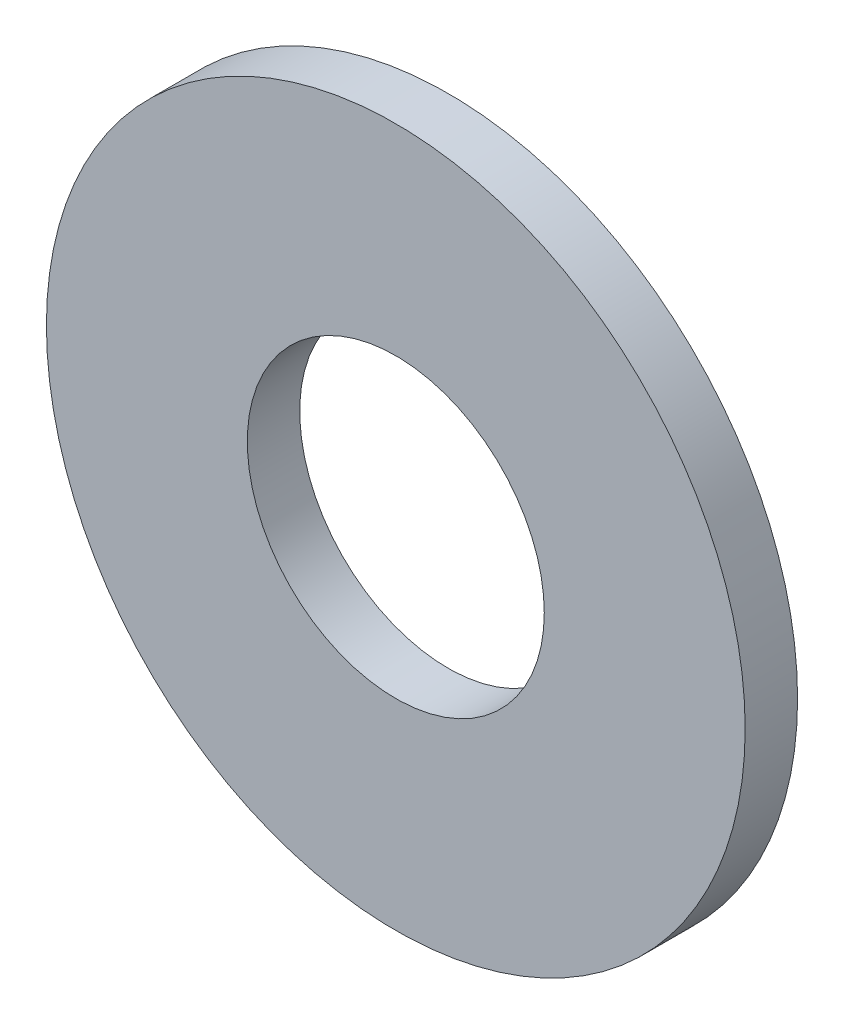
ISO-10303-21;
HEADER;
FILE_DESCRIPTION(('STEP AP214'),'2;1');
FILE_NAME('part.step','',(''),(''),'','','');
FILE_SCHEMA(('AUTOMOTIVE_DESIGN { 1 0 10303 214 1 1 1 1 }'));
ENDSEC;
DATA;
#1=APPLICATION_CONTEXT('core data for automotive mechanical design processes');
#2=APPLICATION_PROTOCOL_DEFINITION('international standard','automotive_design',2000,#1);
#3=PRODUCT_CONTEXT('',#1,'mechanical');
#4=PRODUCT('Part','Part','',(#3));
#5=PRODUCT_RELATED_PRODUCT_CATEGORY('part','',(#4));
#6=PRODUCT_DEFINITION_FORMATION('','',#4);
#7=PRODUCT_DEFINITION_CONTEXT('part definition',#1,'design');
#8=PRODUCT_DEFINITION('design','',#6,#7);
#9=PRODUCT_DEFINITION_SHAPE('','',#8);
#10=(LENGTH_UNIT() NAMED_UNIT(*) SI_UNIT(.MILLI.,.METRE.));
#11=(NAMED_UNIT(*) PLANE_ANGLE_UNIT() SI_UNIT($,.RADIAN.));
#12=(NAMED_UNIT(*) SI_UNIT($,.STERADIAN.) SOLID_ANGLE_UNIT());
#13=UNCERTAINTY_MEASURE_WITH_UNIT(LENGTH_MEASURE(1.E-05),#10,'distance_accuracy_value','');
#14=(GEOMETRIC_REPRESENTATION_CONTEXT(3) GLOBAL_UNCERTAINTY_ASSIGNED_CONTEXT((#13)) GLOBAL_UNIT_ASSIGNED_CONTEXT((#10,
#11,#12)) REPRESENTATION_CONTEXT('',''));
#15=CARTESIAN_POINT('',(0.,0.,0.));
#16=DIRECTION('',(0.,0.,1.));
#17=DIRECTION('',(1.,0.,0.));
#18=AXIS2_PLACEMENT_3D('',#15,#16,#17);
#19=CARTESIAN_POINT('',(0.,0.,1.5));
#20=DIRECTION('',(0.,0.,-1.));
#21=DIRECTION('',(-1.,0.,0.));
#22=AXIS2_PLACEMENT_3D('',#19,#20,#21);
#23=PLANE('',#22);
#24=CARTESIAN_POINT('',(0.,0.,1.5));
#25=DIRECTION('',(0.,0.,1.));
#26=DIRECTION('',(1.,0.,0.));
#27=AXIS2_PLACEMENT_3D('',#24,#25,#26);
#28=CIRCLE('',#27,4.25);
#29=CARTESIAN_POINT('',(4.25,0.,1.5));
#30=VERTEX_POINT('',#29);
#31=EDGE_CURVE('E26',#30,#30,#28,.F.);
#32=ORIENTED_EDGE('',*,*,#31,.T.);
#33=EDGE_LOOP('',(#32));
#34=FACE_BOUND('',#33,.T.);
#35=CARTESIAN_POINT('',(0.,0.,1.5));
#36=DIRECTION('',(0.,0.,1.));
#37=DIRECTION('',(1.,0.,0.));
#38=AXIS2_PLACEMENT_3D('',#35,#36,#37);
#39=CIRCLE('',#38,10.);
#40=CARTESIAN_POINT('',(10.,0.,1.5));
#41=VERTEX_POINT('',#40);
#42=EDGE_CURVE('E17',#41,#41,#39,.F.);
#43=ORIENTED_EDGE('',*,*,#42,.F.);
#44=EDGE_LOOP('',(#43));
#45=FACE_BOUND('',#44,.T.);
#46=ADVANCED_FACE('F14',(#34,#45),#23,.F.);
#47=CARTESIAN_POINT('',(0.,0.,0.));
#48=DIRECTION('',(0.,0.,1.));
#49=DIRECTION('',(1.,0.,0.));
#50=AXIS2_PLACEMENT_3D('',#47,#48,#49);
#51=CYLINDRICAL_SURFACE('',#50,10.);
#52=CARTESIAN_POINT('',(0.,0.,0.));
#53=DIRECTION('',(0.,0.,1.));
#54=DIRECTION('',(1.,0.,0.));
#55=AXIS2_PLACEMENT_3D('',#52,#53,#54);
#56=CIRCLE('',#55,10.);
#57=CARTESIAN_POINT('',(10.,0.,0.));
#58=VERTEX_POINT('',#57);
#59=EDGE_CURVE('E21',#58,#58,#56,.F.);
#60=ORIENTED_EDGE('',*,*,#59,.F.);
#61=EDGE_LOOP('',(#60));
#62=FACE_BOUND('',#61,.T.);
#63=ORIENTED_EDGE('',*,*,#42,.T.);
#64=EDGE_LOOP('',(#63));
#65=FACE_BOUND('',#64,.T.);
#66=ADVANCED_FACE('F34',(#62,#65),#51,.T.);
#67=CARTESIAN_POINT('',(0.,0.,0.));
#68=DIRECTION('',(0.,0.,1.));
#69=DIRECTION('',(1.,0.,0.));
#70=AXIS2_PLACEMENT_3D('',#67,#68,#69);
#71=CYLINDRICAL_SURFACE('',#70,4.25);
#72=CARTESIAN_POINT('',(0.,0.,0.));
#73=DIRECTION('',(0.,0.,1.));
#74=DIRECTION('',(1.,0.,0.));
#75=AXIS2_PLACEMENT_3D('',#72,#73,#74);
#76=CIRCLE('',#75,4.25);
#77=CARTESIAN_POINT('',(4.25,0.,0.));
#78=VERTEX_POINT('',#77);
#79=EDGE_CURVE('E10',#78,#78,#76,.T.);
#80=ORIENTED_EDGE('',*,*,#79,.F.);
#81=EDGE_LOOP('',(#80));
#82=FACE_BOUND('',#81,.T.);
#83=ORIENTED_EDGE('',*,*,#31,.F.);
#84=EDGE_LOOP('',(#83));
#85=FACE_BOUND('',#84,.T.);
#86=ADVANCED_FACE('F41',(#82,#85),#71,.F.);
#87=CARTESIAN_POINT('',(0.,0.,0.));
#88=DIRECTION('',(0.,0.,-1.));
#89=DIRECTION('',(-1.,0.,0.));
#90=AXIS2_PLACEMENT_3D('',#87,#88,#89);
#91=PLANE('',#90);
#92=ORIENTED_EDGE('',*,*,#79,.T.);
#93=EDGE_LOOP('',(#92));
#94=FACE_BOUND('',#93,.T.);
#95=ORIENTED_EDGE('',*,*,#59,.T.);
#96=EDGE_LOOP('',(#95));
#97=FACE_BOUND('',#96,.T.);
#98=ADVANCED_FACE('F43',(#94,#97),#91,.T.);
#99=CLOSED_SHELL('',(#46,#66,#86,#98));
#100=MANIFOLD_SOLID_BREP('B1',#99);
#101=ADVANCED_BREP_SHAPE_REPRESENTATION('',(#18,#100),#14);
#102=SHAPE_DEFINITION_REPRESENTATION(#9,#101);
ENDSEC;
END-ISO-10303-21;
